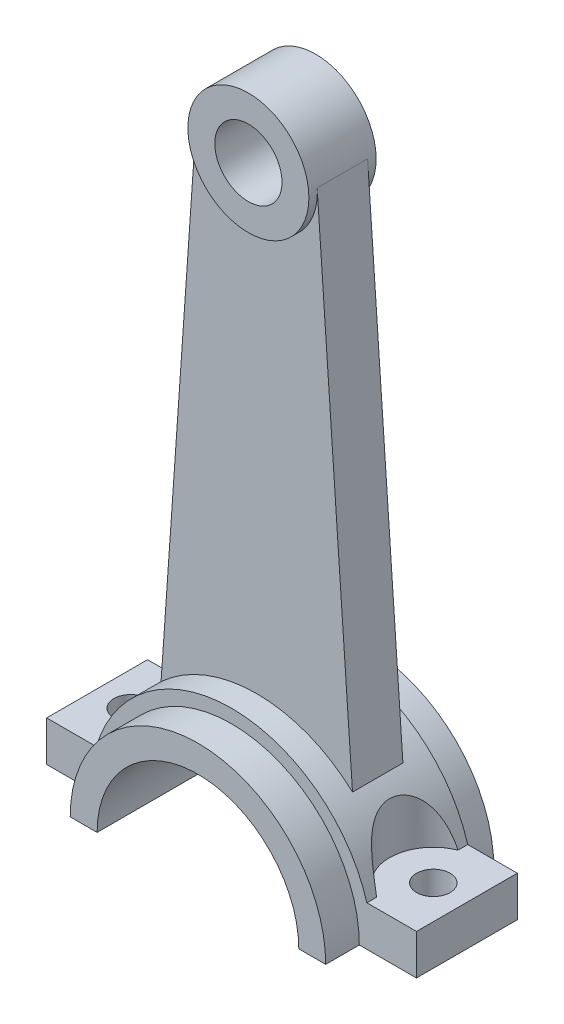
ISO-10303-21;
HEADER;
FILE_DESCRIPTION(('STEP AP214'),'2;1');
FILE_NAME('part.step','',(''),(''),'','','');
FILE_SCHEMA(('AUTOMOTIVE_DESIGN { 1 0 10303 214 1 1 1 1 }'));
ENDSEC;
DATA;
#1=APPLICATION_CONTEXT('core data for automotive mechanical design processes');
#2=APPLICATION_PROTOCOL_DEFINITION('international standard','automotive_design',2000,#1);
#3=PRODUCT_CONTEXT('',#1,'mechanical');
#4=PRODUCT('Part','Part','',(#3));
#5=PRODUCT_RELATED_PRODUCT_CATEGORY('part','',(#4));
#6=PRODUCT_DEFINITION_FORMATION('','',#4);
#7=PRODUCT_DEFINITION_CONTEXT('part definition',#1,'design');
#8=PRODUCT_DEFINITION('design','',#6,#7);
#9=PRODUCT_DEFINITION_SHAPE('','',#8);
#10=(LENGTH_UNIT() NAMED_UNIT(*) SI_UNIT(.MILLI.,.METRE.));
#11=(NAMED_UNIT(*) PLANE_ANGLE_UNIT() SI_UNIT($,.RADIAN.));
#12=(NAMED_UNIT(*) SI_UNIT($,.STERADIAN.) SOLID_ANGLE_UNIT());
#13=UNCERTAINTY_MEASURE_WITH_UNIT(LENGTH_MEASURE(1.E-05),#10,'distance_accuracy_value','');
#14=(GEOMETRIC_REPRESENTATION_CONTEXT(3) GLOBAL_UNCERTAINTY_ASSIGNED_CONTEXT((#13)) GLOBAL_UNIT_ASSIGNED_CONTEXT((#10,
#11,#12)) REPRESENTATION_CONTEXT('',''));
#15=CARTESIAN_POINT('',(0.,0.,0.));
#16=DIRECTION('',(0.,0.,1.));
#17=DIRECTION('',(1.,0.,0.));
#18=AXIS2_PLACEMENT_3D('',#15,#16,#17);
#19=CARTESIAN_POINT('',(0.,0.,15.));
#20=DIRECTION('',(0.,0.,-1.));
#21=DIRECTION('',(-1.,0.,0.));
#22=AXIS2_PLACEMENT_3D('',#19,#20,#21);
#23=CYLINDRICAL_SURFACE('',#22,42.);
#24=CARTESIAN_POINT('',(0.,0.,7.5));
#25=DIRECTION('',(0.,0.,1.));
#26=DIRECTION('',(1.,0.,0.));
#27=AXIS2_PLACEMENT_3D('',#24,#25,#26);
#28=CIRCLE('',#27,42.);
#29=CARTESIAN_POINT('',(28.4716791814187,30.8765847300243,7.5));
#30=VERTEX_POINT('',#29);
#31=CARTESIAN_POINT('',(-28.4716791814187,30.8765847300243,7.5));
#32=VERTEX_POINT('',#31);
#33=EDGE_CURVE('E218',#30,#32,#28,.T.);
#34=ORIENTED_EDGE('',*,*,#33,.T.);
#35=DIRECTION('',(0.,0.,-1.));
#36=VECTOR('',#35,1.);
#37=CARTESIAN_POINT('',(-28.4716791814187,30.8765847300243,7.5));
#38=LINE('',#37,#36);
#39=CARTESIAN_POINT('',(-28.4716791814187,30.8765847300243,-7.5));
#40=VERTEX_POINT('',#39);
#41=EDGE_CURVE('E233',#32,#40,#38,.T.);
#42=ORIENTED_EDGE('',*,*,#41,.T.);
#43=CARTESIAN_POINT('',(0.,0.,-7.5));
#44=DIRECTION('',(0.,0.,1.));
#45=DIRECTION('',(1.,0.,0.));
#46=AXIS2_PLACEMENT_3D('',#43,#44,#45);
#47=CIRCLE('',#46,42.);
#48=CARTESIAN_POINT('',(28.4716791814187,30.8765847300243,-7.5));
#49=VERTEX_POINT('',#48);
#50=EDGE_CURVE('E217',#49,#40,#47,.T.);
#51=ORIENTED_EDGE('',*,*,#50,.F.);
#52=DIRECTION('',(0.,0.,-1.));
#53=VECTOR('',#52,1.);
#54=CARTESIAN_POINT('',(28.4716791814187,30.8765847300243,7.5));
#55=LINE('',#54,#53);
#56=EDGE_CURVE('E257',#30,#49,#55,.T.);
#57=ORIENTED_EDGE('',*,*,#56,.F.);
#58=EDGE_LOOP('',(#34,#42,#51,#57));
#59=FACE_BOUND('',#58,.T.);
#60=DIRECTION('',(0.,0.,-1.));
#61=VECTOR('',#60,1.);
#62=CARTESIAN_POINT('',(40.2492235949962,12.,15.));
#63=LINE('',#62,#61);
#64=CARTESIAN_POINT('',(40.2492235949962,12.,15.));
#65=VERTEX_POINT('',#64);
#66=CARTESIAN_POINT('',(40.2492235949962,12.,12.1008315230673));
#67=VERTEX_POINT('',#66);
#68=EDGE_CURVE('E181',#65,#67,#63,.T.);
#69=ORIENTED_EDGE('',*,*,#68,.T.);
#70=CARTESIAN_POINT('',(40.2492235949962,12.,12.1008315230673));
#71=CARTESIAN_POINT('',(40.1309175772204,12.3968494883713,12.0543503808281));
#72=CARTESIAN_POINT('',(40.0068464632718,12.791522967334,12.0036697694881));
#73=CARTESIAN_POINT('',(39.747518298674,13.5759058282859,11.8925006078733));
#74=CARTESIAN_POINT('',(39.6122579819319,13.9656137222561,11.8320091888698));
#75=CARTESIAN_POINT('',(39.3301839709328,14.7413691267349,11.6994678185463));
#76=CARTESIAN_POINT('',(39.1833102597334,15.1273842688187,11.6273555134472));
#77=CARTESIAN_POINT('',(38.8792223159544,15.8926255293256,11.4701956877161));
#78=CARTESIAN_POINT('',(38.7220090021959,16.271852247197,11.3851493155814));
#79=CARTESIAN_POINT('',(38.3953697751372,17.0284470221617,11.1988733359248));
#80=CARTESIAN_POINT('',(38.2257905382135,17.4056917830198,11.0974099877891));
#81=CARTESIAN_POINT('',(37.8775953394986,18.1509483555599,10.8772143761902));
#82=CARTESIAN_POINT('',(37.6989783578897,18.5189591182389,10.7584801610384));
#83=CARTESIAN_POINT('',(37.3344196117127,19.2433129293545,10.5018308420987));
#84=CARTESIAN_POINT('',(37.1484969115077,19.599682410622,10.3639635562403));
#85=CARTESIAN_POINT('',(36.7705803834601,20.2998164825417,10.0665020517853));
#86=CARTESIAN_POINT('',(36.5785886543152,20.6435853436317,9.90691528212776));
#87=CARTESIAN_POINT('',(36.2204090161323,21.2647608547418,9.58993351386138));
#88=CARTESIAN_POINT('',(36.0547910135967,21.5442458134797,9.43597223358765));
#89=CARTESIAN_POINT('',(35.7222466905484,22.091254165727,9.10920625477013));
#90=CARTESIAN_POINT('',(35.5553202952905,22.3587768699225,8.93640047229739));
#91=CARTESIAN_POINT('',(35.222568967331,22.8793750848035,8.57103964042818));
#92=CARTESIAN_POINT('',(35.0567422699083,23.1324881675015,8.37853999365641));
#93=CARTESIAN_POINT('',(34.7280540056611,23.6230698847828,7.97216452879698));
#94=CARTESIAN_POINT('',(34.5651923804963,23.8605388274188,7.75828913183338));
#95=CARTESIAN_POINT('',(34.242873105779,24.3208905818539,7.30497501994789));
#96=CARTESIAN_POINT('',(34.0834981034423,24.5435144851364,7.06521288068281));
#97=CARTESIAN_POINT('',(33.7739183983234,24.9678077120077,6.56218584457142));
#98=CARTESIAN_POINT('',(33.6237146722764,25.1694748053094,6.29891845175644));
#99=CARTESIAN_POINT('',(33.3364418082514,25.5487412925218,5.7495507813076));
#100=CARTESIAN_POINT('',(33.1993524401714,25.7263779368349,5.46348696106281));
#101=CARTESIAN_POINT('',(32.9420563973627,26.0550283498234,4.86935523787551));
#102=CARTESIAN_POINT('',(32.8218410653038,26.206055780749,4.56129874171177));
#103=CARTESIAN_POINT('',(32.6365331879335,26.4361725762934,4.0247103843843));
#104=CARTESIAN_POINT('',(32.5659450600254,26.5230044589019,3.80135703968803));
#105=CARTESIAN_POINT('',(32.4358515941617,26.6819429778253,3.34635794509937));
#106=CARTESIAN_POINT('',(32.3763435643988,26.7540531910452,3.11471422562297));
#107=CARTESIAN_POINT('',(32.2695332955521,26.882786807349,2.64449056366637));
#108=CARTESIAN_POINT('',(32.222226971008,26.9394153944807,2.40591297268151));
#109=CARTESIAN_POINT('',(32.140727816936,27.0365982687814,1.92328011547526));
#110=CARTESIAN_POINT('',(32.1065355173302,27.077151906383,1.67922462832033));
#111=CARTESIAN_POINT('',(32.0518873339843,27.1418187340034,1.18658958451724));
#112=CARTESIAN_POINT('',(32.0314769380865,27.1658774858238,0.937997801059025));
#113=CARTESIAN_POINT('',(32.005012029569,27.1970518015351,0.438989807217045));
#114=CARTESIAN_POINT('',(31.9989574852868,27.2041674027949,0.188573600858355));
#115=CARTESIAN_POINT('',(32.0013358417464,27.2013695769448,-0.312076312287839));
#116=CARTESIAN_POINT('',(32.009767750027,27.1914573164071,-0.562310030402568));
#117=CARTESIAN_POINT('',(32.0409340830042,27.1547255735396,-1.06062701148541));
#118=CARTESIAN_POINT('',(32.0636680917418,27.1279065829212,-1.30871033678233));
#119=CARTESIAN_POINT('',(32.1214429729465,27.0594676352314,-1.78833114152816));
#120=CARTESIAN_POINT('',(32.1558004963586,27.0186681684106,-2.02006923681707));
#121=CARTESIAN_POINT('',(32.2363159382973,26.92255299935,-2.47840820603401));
#122=CARTESIAN_POINT('',(32.282473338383,26.8672379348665,-2.70500930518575));
#123=CARTESIAN_POINT('',(32.3857571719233,26.7426488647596,-3.15173505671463));
#124=CARTESIAN_POINT('',(32.4428822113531,26.6733766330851,-3.37186052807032));
#125=CARTESIAN_POINT('',(32.5671588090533,26.5214968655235,-3.80462539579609));
#126=CARTESIAN_POINT('',(32.6343140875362,26.4388843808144,-4.0172619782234));
#127=CARTESIAN_POINT('',(32.7818239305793,26.2557920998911,-4.4464191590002));
#128=CARTESIAN_POINT('',(32.8627245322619,26.1545440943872,-4.66242449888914));
#129=CARTESIAN_POINT('',(33.0332569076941,25.9388300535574,-5.08417948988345));
#130=CARTESIAN_POINT('',(33.1228920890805,25.824358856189,-5.28992509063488));
#131=CARTESIAN_POINT('',(33.4029039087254,25.462493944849,-5.89087373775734));
#132=CARTESIAN_POINT('',(33.6044530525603,25.1965679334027,-6.26997592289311));
#133=CARTESIAN_POINT('',(33.9762542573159,24.6918579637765,-6.89759313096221));
#134=CARTESIAN_POINT('',(34.1425010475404,24.4617348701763,-7.15568508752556));
#135=CARTESIAN_POINT('',(34.4822895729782,23.9803760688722,-7.64635612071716));
#136=CARTESIAN_POINT('',(34.65583437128,23.7291314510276,-7.87892433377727));
#137=CARTESIAN_POINT('',(35.0069944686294,23.2079570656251,-8.31982468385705));
#138=CARTESIAN_POINT('',(35.184616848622,22.9379928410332,-8.52811012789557));
#139=CARTESIAN_POINT('',(35.540711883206,22.3822882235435,-8.92144710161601));
#140=CARTESIAN_POINT('',(35.719184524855,22.0965480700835,-9.10649898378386));
#141=CARTESIAN_POINT('',(36.1676144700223,21.3582539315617,-9.546356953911));
#142=CARTESIAN_POINT('',(36.4365844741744,20.8966371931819,-9.78700619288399));
#143=CARTESIAN_POINT('',(36.9645825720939,19.9478076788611,-10.2249588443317));
#144=CARTESIAN_POINT('',(37.2236045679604,19.4605796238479,-10.4222360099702));
#145=CARTESIAN_POINT('',(37.7276625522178,18.4644458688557,-10.780019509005));
#146=CARTESIAN_POINT('',(37.9726662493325,17.955494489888,-10.9404433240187));
#147=CARTESIAN_POINT('',(38.4448252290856,16.9209588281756,-11.2297046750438));
#148=CARTESIAN_POINT('',(38.6719856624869,16.3953794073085,-11.3585513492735));
#149=CARTESIAN_POINT('',(39.1459118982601,15.2334949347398,-11.6109593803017));
#150=CARTESIAN_POINT('',(39.3887267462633,14.5944403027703,-11.729295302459));
#151=CARTESIAN_POINT('',(39.7294482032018,13.626704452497,-11.884301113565));
#152=CARTESIAN_POINT('',(39.8387770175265,13.303700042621,-11.9320968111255));
#153=CARTESIAN_POINT('',(40.0497825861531,12.6543053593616,-12.0211654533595));
#154=CARTESIAN_POINT('',(40.1514592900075,12.3279150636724,-12.0624383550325));
#155=CARTESIAN_POINT('',(40.2492235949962,12.,-12.1008315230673));
#156=B_SPLINE_CURVE_WITH_KNOTS('',3,(#70,#71,#72,#73,#74,#75,#76,#77,#78,#79,#80,#81,#82,#83,
#84,#85,#86,#87,#88,#89,#90,#91,#92,#93,#94,#95,#96,#97,#98,#99,#100,#101,#102,#103,#104,#105,
#106,#107,#108,#109,#110,#111,#112,#113,#114,#115,#116,#117,#118,#119,#120,#121,#122,#123,#124,
#125,#126,#127,#128,#129,#130,#131,#132,#133,#134,#135,#136,#137,#138,#139,#140,#141,#142,#143,
#144,#145,#146,#147,#148,#149,#150,#151,#152,#153,#154,#155),.UNSPECIFIED.,.F.,.F.,(4,2,2,2,2,2,
2,2,2,2,2,2,2,2,2,2,2,2,2,2,2,2,2,2,2,2,2,2,2,2,2,2,2,2,2,2,2,2,2,2,2,2,4),(0.,1.25010931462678,
2.50058482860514,3.75800820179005,5.0153199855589,6.29242991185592,7.56968426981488,
8.84380211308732,10.1174840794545,11.1953857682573,12.2733494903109,13.3483599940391,
14.4233493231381,15.5137997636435,16.6043661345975,17.6932221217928,18.7815174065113,
19.5302379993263,20.2787764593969,21.0270639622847,21.7753816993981,22.5261573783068,
23.276931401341,24.0276539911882,24.7783547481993,25.4909459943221,26.2035059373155,
26.9159753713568,27.6287097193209,28.3836371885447,29.1388603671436,30.6486691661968,
31.7982708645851,32.9483599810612,34.1006253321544,35.2528731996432,37.0079443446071,
38.7640746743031,40.5240996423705,42.2836146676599,44.3632126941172,45.3960974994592,
46.4289891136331),.UNSPECIFIED.);
#157=CARTESIAN_POINT('',(40.2492235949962,12.,-12.1008315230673));
#158=VERTEX_POINT('',#157);
#159=EDGE_CURVE('E171',#67,#158,#156,.T.);
#160=ORIENTED_EDGE('',*,*,#159,.T.);
#161=CARTESIAN_POINT('',(40.2492235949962,12.,-15.));
#162=VERTEX_POINT('',#161);
#163=EDGE_CURVE('E178',#158,#162,#63,.T.);
#164=ORIENTED_EDGE('',*,*,#163,.T.);
#165=CARTESIAN_POINT('',(0.,0.,-15.));
#166=DIRECTION('',(0.,0.,1.));
#167=DIRECTION('',(1.,0.,0.));
#168=AXIS2_PLACEMENT_3D('',#165,#166,#167);
#169=CIRCLE('',#168,42.);
#170=CARTESIAN_POINT('',(-40.2492235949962,12.,-15.));
#171=VERTEX_POINT('',#170);
#172=EDGE_CURVE('E449',#162,#171,#169,.T.);
#173=ORIENTED_EDGE('',*,*,#172,.T.);
#174=DIRECTION('',(0.,0.,-1.));
#175=VECTOR('',#174,1.);
#176=CARTESIAN_POINT('',(-40.2492235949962,12.,15.));
#177=LINE('',#176,#175);
#178=CARTESIAN_POINT('',(-40.2492235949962,12.,-12.1008315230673));
#179=VERTEX_POINT('',#178);
#180=EDGE_CURVE('E213',#179,#171,#177,.T.);
#181=ORIENTED_EDGE('',*,*,#180,.F.);
#182=CARTESIAN_POINT('',(-40.2492235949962,12.,12.1008315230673));
#183=CARTESIAN_POINT('',(-40.1309175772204,12.3968494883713,12.0543503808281));
#184=CARTESIAN_POINT('',(-40.0068464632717,12.7915229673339,12.0036697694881));
#185=CARTESIAN_POINT('',(-39.747518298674,13.5759058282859,11.8925006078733));
#186=CARTESIAN_POINT('',(-39.6122579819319,13.9656137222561,11.8320091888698));
#187=CARTESIAN_POINT('',(-39.3301839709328,14.7413691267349,11.6994678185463));
#188=CARTESIAN_POINT('',(-39.1833102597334,15.1273842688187,11.6273555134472));
#189=CARTESIAN_POINT('',(-38.8792223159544,15.8926255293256,11.4701956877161));
#190=CARTESIAN_POINT('',(-38.7220090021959,16.271852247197,11.3851493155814));
#191=CARTESIAN_POINT('',(-38.3953697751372,17.0284470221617,11.1988733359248));
#192=CARTESIAN_POINT('',(-38.2257905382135,17.4056917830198,11.0974099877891));
#193=CARTESIAN_POINT('',(-37.8775953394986,18.1509483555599,10.8772143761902));
#194=CARTESIAN_POINT('',(-37.6989783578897,18.5189591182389,10.7584801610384));
#195=CARTESIAN_POINT('',(-37.3344196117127,19.2433129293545,10.5018308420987));
#196=CARTESIAN_POINT('',(-37.1484969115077,19.599682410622,10.3639635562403));
#197=CARTESIAN_POINT('',(-36.7705803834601,20.2998164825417,10.0665020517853));
#198=CARTESIAN_POINT('',(-36.5785886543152,20.6435853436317,9.90691528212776));
#199=CARTESIAN_POINT('',(-36.2204090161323,21.2647608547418,9.58993351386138));
#200=CARTESIAN_POINT('',(-36.0547910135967,21.5442458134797,9.43597223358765));
#201=CARTESIAN_POINT('',(-35.7222466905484,22.091254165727,9.10920625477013));
#202=CARTESIAN_POINT('',(-35.5553202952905,22.3587768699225,8.93640047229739));
#203=CARTESIAN_POINT('',(-35.222568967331,22.8793750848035,8.57103964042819));
#204=CARTESIAN_POINT('',(-35.0567422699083,23.1324881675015,8.37853999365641));
#205=CARTESIAN_POINT('',(-34.7280540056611,23.6230698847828,7.97216452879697));
#206=CARTESIAN_POINT('',(-34.5651923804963,23.8605388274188,7.75828913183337));
#207=CARTESIAN_POINT('',(-34.242873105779,24.3208905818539,7.30497501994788));
#208=CARTESIAN_POINT('',(-34.0834981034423,24.5435144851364,7.06521288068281));
#209=CARTESIAN_POINT('',(-33.7739183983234,24.9678077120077,6.56218584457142));
#210=CARTESIAN_POINT('',(-33.6237146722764,25.1694748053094,6.29891845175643));
#211=CARTESIAN_POINT('',(-33.3364418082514,25.5487412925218,5.7495507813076));
#212=CARTESIAN_POINT('',(-33.1993524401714,25.7263779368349,5.46348696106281));
#213=CARTESIAN_POINT('',(-32.9420563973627,26.0550283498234,4.86935523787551));
#214=CARTESIAN_POINT('',(-32.8218410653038,26.206055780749,4.56129874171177));
#215=CARTESIAN_POINT('',(-32.6365331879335,26.4361725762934,4.02471038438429));
#216=CARTESIAN_POINT('',(-32.5659450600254,26.5230044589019,3.80135703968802));
#217=CARTESIAN_POINT('',(-32.4358515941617,26.6819429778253,3.34635794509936));
#218=CARTESIAN_POINT('',(-32.3763435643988,26.7540531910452,3.11471422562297));
#219=CARTESIAN_POINT('',(-32.2695332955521,26.882786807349,2.64449056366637));
#220=CARTESIAN_POINT('',(-32.222226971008,26.9394153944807,2.4059129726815));
#221=CARTESIAN_POINT('',(-32.140727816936,27.0365982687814,1.92328011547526));
#222=CARTESIAN_POINT('',(-32.1065355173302,27.077151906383,1.67922462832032));
#223=CARTESIAN_POINT('',(-32.0518873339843,27.1418187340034,1.18658958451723));
#224=CARTESIAN_POINT('',(-32.0314769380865,27.1658774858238,0.937997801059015));
#225=CARTESIAN_POINT('',(-32.005012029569,27.197051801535,0.438989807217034));
#226=CARTESIAN_POINT('',(-31.9989574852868,27.2041674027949,0.188573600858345));
#227=CARTESIAN_POINT('',(-32.0013358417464,27.2013695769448,-0.312076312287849));
#228=CARTESIAN_POINT('',(-32.009767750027,27.1914573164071,-0.562310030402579));
#229=CARTESIAN_POINT('',(-32.0409340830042,27.1547255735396,-1.06062701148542));
#230=CARTESIAN_POINT('',(-32.0636680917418,27.1279065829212,-1.30871033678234));
#231=CARTESIAN_POINT('',(-32.1214429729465,27.0594676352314,-1.78833114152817));
#232=CARTESIAN_POINT('',(-32.1558004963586,27.0186681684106,-2.02006923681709));
#233=CARTESIAN_POINT('',(-32.2363159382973,26.92255299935,-2.47840820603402));
#234=CARTESIAN_POINT('',(-32.282473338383,26.8672379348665,-2.70500930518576));
#235=CARTESIAN_POINT('',(-32.3857571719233,26.7426488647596,-3.15173505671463));
#236=CARTESIAN_POINT('',(-32.4428822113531,26.6733766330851,-3.37186052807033));
#237=CARTESIAN_POINT('',(-32.5671588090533,26.5214968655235,-3.8046253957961));
#238=CARTESIAN_POINT('',(-32.6343140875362,26.4388843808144,-4.01726197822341));
#239=CARTESIAN_POINT('',(-32.7818239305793,26.2557920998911,-4.44641915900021));
#240=CARTESIAN_POINT('',(-32.8627245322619,26.1545440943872,-4.66242449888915));
#241=CARTESIAN_POINT('',(-33.0332569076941,25.9388300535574,-5.08417948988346));
#242=CARTESIAN_POINT('',(-33.1228920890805,25.824358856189,-5.28992509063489));
#243=CARTESIAN_POINT('',(-33.4029039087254,25.462493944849,-5.89087373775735));
#244=CARTESIAN_POINT('',(-33.6044530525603,25.1965679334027,-6.26997592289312));
#245=CARTESIAN_POINT('',(-33.9762542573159,24.6918579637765,-6.89759313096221));
#246=CARTESIAN_POINT('',(-34.1425010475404,24.4617348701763,-7.15568508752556));
#247=CARTESIAN_POINT('',(-34.4822895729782,23.9803760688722,-7.64635612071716));
#248=CARTESIAN_POINT('',(-34.65583437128,23.7291314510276,-7.87892433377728));
#249=CARTESIAN_POINT('',(-35.0069944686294,23.2079570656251,-8.31982468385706));
#250=CARTESIAN_POINT('',(-35.184616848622,22.9379928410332,-8.52811012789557));
#251=CARTESIAN_POINT('',(-35.540711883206,22.3822882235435,-8.92144710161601));
#252=CARTESIAN_POINT('',(-35.719184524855,22.0965480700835,-9.10649898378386));
#253=CARTESIAN_POINT('',(-36.1676144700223,21.3582539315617,-9.546356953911));
#254=CARTESIAN_POINT('',(-36.4365844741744,20.8966371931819,-9.78700619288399));
#255=CARTESIAN_POINT('',(-36.9645825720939,19.9478076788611,-10.2249588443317));
#256=CARTESIAN_POINT('',(-37.2236045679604,19.4605796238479,-10.4222360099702));
#257=CARTESIAN_POINT('',(-37.7276625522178,18.4644458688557,-10.780019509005));
#258=CARTESIAN_POINT('',(-37.9726662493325,17.955494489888,-10.9404433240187));
#259=CARTESIAN_POINT('',(-38.4448252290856,16.9209588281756,-11.2297046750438));
#260=CARTESIAN_POINT('',(-38.6719856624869,16.3953794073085,-11.3585513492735));
#261=CARTESIAN_POINT('',(-39.1459118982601,15.2334949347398,-11.6109593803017));
#262=CARTESIAN_POINT('',(-39.3887267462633,14.5944403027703,-11.729295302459));
#263=CARTESIAN_POINT('',(-39.7294482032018,13.626704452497,-11.884301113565));
#264=CARTESIAN_POINT('',(-39.8387770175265,13.303700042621,-11.9320968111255));
#265=CARTESIAN_POINT('',(-40.0497825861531,12.6543053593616,-12.0211654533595));
#266=CARTESIAN_POINT('',(-40.1514592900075,12.3279150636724,-12.0624383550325));
#267=CARTESIAN_POINT('',(-40.2492235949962,12.,-12.1008315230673));
#268=B_SPLINE_CURVE_WITH_KNOTS('',3,(#182,#183,#184,#185,#186,#187,#188,#189,#190,#191,#192,
#193,#194,#195,#196,#197,#198,#199,#200,#201,#202,#203,#204,#205,#206,#207,#208,#209,#210,#211,
#212,#213,#214,#215,#216,#217,#218,#219,#220,#221,#222,#223,#224,#225,#226,#227,#228,#229,#230,
#231,#232,#233,#234,#235,#236,#237,#238,#239,#240,#241,#242,#243,#244,#245,#246,#247,#248,#249,
#250,#251,#252,#253,#254,#255,#256,#257,#258,#259,#260,#261,#262,#263,#264,#265,#266,#267),
.UNSPECIFIED.,.F.,.F.,(4,2,2,2,2,2,2,2,2,2,2,2,2,2,2,2,2,2,2,2,2,2,2,2,2,2,2,2,2,2,2,2,2,2,2,2,
2,2,2,2,2,2,4),(0.,1.25010931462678,2.50058482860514,3.75800820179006,5.01531998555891,
6.29242991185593,7.56968426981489,8.84380211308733,10.1174840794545,11.1953857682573,
12.2733494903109,13.3483599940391,14.4233493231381,15.5137997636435,16.6043661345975,
17.6932221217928,18.7815174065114,19.5302379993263,20.2787764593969,21.0270639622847,
21.7753816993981,22.5261573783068,23.276931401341,24.0276539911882,24.7783547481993,
25.4909459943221,26.2035059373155,26.9159753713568,27.6287097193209,28.3836371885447,
29.1388603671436,30.6486691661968,31.7982708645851,32.9483599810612,34.1006253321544,
35.2528731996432,37.0079443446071,38.7640746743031,40.5240996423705,42.2836146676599,
44.3632126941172,45.3960974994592,46.4289891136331),.UNSPECIFIED.);
#269=CARTESIAN_POINT('',(-40.2492235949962,12.,12.1008315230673));
#270=VERTEX_POINT('',#269);
#271=EDGE_CURVE('E309',#270,#179,#268,.T.);
#272=ORIENTED_EDGE('',*,*,#271,.F.);
#273=CARTESIAN_POINT('',(-40.2492235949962,12.,15.));
#274=VERTEX_POINT('',#273);
#275=EDGE_CURVE('E214',#274,#270,#177,.T.);
#276=ORIENTED_EDGE('',*,*,#275,.F.);
#277=CARTESIAN_POINT('',(0.,0.,15.));
#278=DIRECTION('',(0.,0.,1.));
#279=DIRECTION('',(1.,0.,0.));
#280=AXIS2_PLACEMENT_3D('',#277,#278,#279);
#281=CIRCLE('',#280,42.);
#282=EDGE_CURVE('E416',#65,#274,#281,.T.);
#283=ORIENTED_EDGE('',*,*,#282,.F.);
#284=EDGE_LOOP('',(#69,#160,#164,#173,#181,#272,#276,#283));
#285=FACE_BOUND('',#284,.T.);
#286=ADVANCED_FACE('F43',(#59,#285),#23,.T.);
#287=CARTESIAN_POINT('',(0.,180.,10.));
#288=DIRECTION('',(0.,0.,-1.));
#289=DIRECTION('',(-1.,0.,0.));
#290=AXIS2_PLACEMENT_3D('',#287,#288,#289);
#291=CYLINDRICAL_SURFACE('',#290,10.);
#292=CARTESIAN_POINT('',(0.,180.,10.));
#293=DIRECTION('',(0.,0.,1.));
#294=DIRECTION('',(1.,0.,0.));
#295=AXIS2_PLACEMENT_3D('',#292,#293,#294);
#296=CIRCLE('',#295,10.);
#297=CARTESIAN_POINT('',(10.,180.,10.));
#298=VERTEX_POINT('',#297);
#299=EDGE_CURVE('E53',#298,#298,#296,.T.);
#300=ORIENTED_EDGE('',*,*,#299,.T.);
#301=EDGE_LOOP('',(#300));
#302=FACE_BOUND('',#301,.T.);
#303=CARTESIAN_POINT('',(0.,180.,-10.));
#304=DIRECTION('',(0.,0.,1.));
#305=DIRECTION('',(1.,0.,0.));
#306=AXIS2_PLACEMENT_3D('',#303,#304,#305);
#307=CIRCLE('',#306,10.);
#308=CARTESIAN_POINT('',(10.,180.,-10.));
#309=VERTEX_POINT('',#308);
#310=EDGE_CURVE('E261',#309,#309,#307,.T.);
#311=ORIENTED_EDGE('',*,*,#310,.F.);
#312=EDGE_LOOP('',(#311));
#313=FACE_BOUND('',#312,.T.);
#314=ADVANCED_FACE('F45',(#302,#313),#291,.F.);
#315=CARTESIAN_POINT('',(0.,180.,10.));
#316=DIRECTION('',(0.,0.,-1.));
#317=DIRECTION('',(-1.,0.,0.));
#318=AXIS2_PLACEMENT_3D('',#315,#316,#317);
#319=CYLINDRICAL_SURFACE('',#318,18.);
#320=DIRECTION('',(0.,0.,-1.));
#321=VECTOR('',#320,1.);
#322=CARTESIAN_POINT('',(-17.9561529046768,181.255616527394,7.5));
#323=LINE('',#322,#321);
#324=CARTESIAN_POINT('',(-17.9561529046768,181.255616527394,7.5));
#325=VERTEX_POINT('',#324);
#326=CARTESIAN_POINT('',(-17.9561529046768,181.255616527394,-7.5));
#327=VERTEX_POINT('',#326);
#328=EDGE_CURVE('E250',#325,#327,#323,.T.);
#329=ORIENTED_EDGE('',*,*,#328,.F.);
#330=CARTESIAN_POINT('',(0.,180.,7.5));
#331=DIRECTION('',(0.,0.,1.));
#332=DIRECTION('',(1.,0.,0.));
#333=AXIS2_PLACEMENT_3D('',#330,#331,#332);
#334=CIRCLE('',#333,18.);
#335=CARTESIAN_POINT('',(17.9561529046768,181.255616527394,7.5));
#336=VERTEX_POINT('',#335);
#337=EDGE_CURVE('E226',#325,#336,#334,.T.);
#338=ORIENTED_EDGE('',*,*,#337,.T.);
#339=DIRECTION('',(0.,0.,-1.));
#340=VECTOR('',#339,1.);
#341=CARTESIAN_POINT('',(17.9561529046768,181.255616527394,7.5));
#342=LINE('',#341,#340);
#343=CARTESIAN_POINT('',(17.9561529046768,181.255616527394,-7.5));
#344=VERTEX_POINT('',#343);
#345=EDGE_CURVE('E254',#336,#344,#342,.T.);
#346=ORIENTED_EDGE('',*,*,#345,.T.);
#347=CARTESIAN_POINT('',(0.,180.,-7.5));
#348=DIRECTION('',(0.,0.,1.));
#349=DIRECTION('',(1.,0.,0.));
#350=AXIS2_PLACEMENT_3D('',#347,#348,#349);
#351=CIRCLE('',#350,18.);
#352=EDGE_CURVE('E241',#327,#344,#351,.T.);
#353=ORIENTED_EDGE('',*,*,#352,.F.);
#354=EDGE_LOOP('',(#329,#338,#346,#353));
#355=FACE_BOUND('',#354,.T.);
#356=CARTESIAN_POINT('',(0.,180.,10.));
#357=DIRECTION('',(0.,0.,1.));
#358=DIRECTION('',(1.,0.,0.));
#359=AXIS2_PLACEMENT_3D('',#356,#357,#358);
#360=CIRCLE('',#359,18.);
#361=CARTESIAN_POINT('',(18.,180.,10.));
#362=VERTEX_POINT('',#361);
#363=EDGE_CURVE('E11',#362,#362,#360,.T.);
#364=ORIENTED_EDGE('',*,*,#363,.F.);
#365=EDGE_LOOP('',(#364));
#366=FACE_BOUND('',#365,.T.);
#367=CARTESIAN_POINT('',(0.,180.,-10.));
#368=DIRECTION('',(0.,0.,1.));
#369=DIRECTION('',(1.,0.,0.));
#370=AXIS2_PLACEMENT_3D('',#367,#368,#369);
#371=CIRCLE('',#370,18.);
#372=CARTESIAN_POINT('',(18.,180.,-10.));
#373=VERTEX_POINT('',#372);
#374=EDGE_CURVE('E47',#373,#373,#371,.T.);
#375=ORIENTED_EDGE('',*,*,#374,.T.);
#376=EDGE_LOOP('',(#375));
#377=FACE_BOUND('',#376,.T.);
#378=ADVANCED_FACE('F274',(#355,#366,#377),#319,.T.);
#379=CARTESIAN_POINT('',(0.,0.,10.));
#380=DIRECTION('',(0.,0.,1.));
#381=DIRECTION('',(1.,0.,0.));
#382=AXIS2_PLACEMENT_3D('',#379,#380,#381);
#383=PLANE('',#382);
#384=ORIENTED_EDGE('',*,*,#299,.F.);
#385=EDGE_LOOP('',(#384));
#386=FACE_BOUND('',#385,.T.);
#387=ORIENTED_EDGE('',*,*,#363,.T.);
#388=EDGE_LOOP('',(#387));
#389=FACE_BOUND('',#388,.T.);
#390=ADVANCED_FACE('F279',(#386,#389),#383,.T.);
#391=CARTESIAN_POINT('',(0.,0.,-10.));
#392=DIRECTION('',(0.,0.,1.));
#393=DIRECTION('',(1.,0.,0.));
#394=AXIS2_PLACEMENT_3D('',#391,#392,#393);
#395=PLANE('',#394);
#396=ORIENTED_EDGE('',*,*,#310,.T.);
#397=EDGE_LOOP('',(#396));
#398=FACE_BOUND('',#397,.T.);
#399=ORIENTED_EDGE('',*,*,#374,.F.);
#400=EDGE_LOOP('',(#399));
#401=FACE_BOUND('',#400,.T.);
#402=ADVANCED_FACE('F276',(#398,#401),#395,.F.);
#403=CARTESIAN_POINT('',(30.4817319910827,2.13149034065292,7.5));
#404=DIRECTION('',(0.997564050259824,0.0697564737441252,0.));
#405=DIRECTION('',(-0.0697564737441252,0.997564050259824,0.));
#406=AXIS2_PLACEMENT_3D('',#403,#404,#405);
#407=PLANE('',#406);
#408=DIRECTION('',(0.0697564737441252,-0.997564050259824,0.));
#409=VECTOR('',#408,1.);
#410=CARTESIAN_POINT('',(30.4817319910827,2.13149034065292,-7.5));
#411=LINE('',#410,#409);
#412=EDGE_CURVE('E237',#344,#49,#411,.T.);
#413=ORIENTED_EDGE('',*,*,#412,.F.);
#414=ORIENTED_EDGE('',*,*,#345,.F.);
#415=DIRECTION('',(0.0697564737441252,-0.997564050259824,0.));
#416=VECTOR('',#415,1.);
#417=CARTESIAN_POINT('',(30.4817319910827,2.13149034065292,7.5));
#418=LINE('',#417,#416);
#419=EDGE_CURVE('E221',#336,#30,#418,.T.);
#420=ORIENTED_EDGE('',*,*,#419,.T.);
#421=ORIENTED_EDGE('',*,*,#56,.T.);
#422=EDGE_LOOP('',(#413,#414,#420,#421));
#423=FACE_BOUND('',#422,.T.);
#424=ADVANCED_FACE('F278',(#423),#407,.T.);
#425=CARTESIAN_POINT('',(-30.4817319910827,2.13149034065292,7.5));
#426=DIRECTION('',(0.997564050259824,-0.0697564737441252,0.));
#427=DIRECTION('',(0.0697564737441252,0.997564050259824,0.));
#428=AXIS2_PLACEMENT_3D('',#425,#426,#427);
#429=PLANE('',#428);
#430=DIRECTION('',(-0.0697564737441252,-0.997564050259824,0.));
#431=VECTOR('',#430,1.);
#432=CARTESIAN_POINT('',(-30.4817319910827,2.13149034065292,-7.5));
#433=LINE('',#432,#431);
#434=EDGE_CURVE('E222',#327,#40,#433,.T.);
#435=ORIENTED_EDGE('',*,*,#434,.T.);
#436=ORIENTED_EDGE('',*,*,#41,.F.);
#437=DIRECTION('',(-0.0697564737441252,-0.997564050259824,0.));
#438=VECTOR('',#437,1.);
#439=CARTESIAN_POINT('',(-30.4817319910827,2.13149034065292,7.5));
#440=LINE('',#439,#438);
#441=EDGE_CURVE('E229',#325,#32,#440,.T.);
#442=ORIENTED_EDGE('',*,*,#441,.F.);
#443=ORIENTED_EDGE('',*,*,#328,.T.);
#444=EDGE_LOOP('',(#435,#436,#442,#443));
#445=FACE_BOUND('',#444,.T.);
#446=ADVANCED_FACE('F286',(#445),#429,.F.);
#447=CARTESIAN_POINT('',(0.,0.,7.5));
#448=DIRECTION('',(0.,0.,1.));
#449=DIRECTION('',(1.,0.,0.));
#450=AXIS2_PLACEMENT_3D('',#447,#448,#449);
#451=PLANE('',#450);
#452=ORIENTED_EDGE('',*,*,#33,.F.);
#453=ORIENTED_EDGE('',*,*,#419,.F.);
#454=ORIENTED_EDGE('',*,*,#337,.F.);
#455=ORIENTED_EDGE('',*,*,#441,.T.);
#456=EDGE_LOOP('',(#452,#453,#454,#455));
#457=FACE_BOUND('',#456,.T.);
#458=ADVANCED_FACE('F305',(#457),#451,.T.);
#459=CARTESIAN_POINT('',(0.,0.,-7.5));
#460=DIRECTION('',(0.,0.,1.));
#461=DIRECTION('',(1.,0.,0.));
#462=AXIS2_PLACEMENT_3D('',#459,#460,#461);
#463=PLANE('',#462);
#464=ORIENTED_EDGE('',*,*,#50,.T.);
#465=ORIENTED_EDGE('',*,*,#434,.F.);
#466=ORIENTED_EDGE('',*,*,#352,.T.);
#467=ORIENTED_EDGE('',*,*,#412,.T.);
#468=EDGE_LOOP('',(#464,#465,#466,#467));
#469=FACE_BOUND('',#468,.T.);
#470=ADVANCED_FACE('F382',(#469),#463,.F.);
#471=CARTESIAN_POINT('',(0.,12.,15.));
#472=DIRECTION('',(0.,1.,0.));
#473=DIRECTION('',(0.,0.,1.));
#474=AXIS2_PLACEMENT_3D('',#471,#472,#473);
#475=PLANE('',#474);
#476=CARTESIAN_POINT('',(-45.,12.,0.));
#477=DIRECTION('',(0.,1.,0.));
#478=DIRECTION('',(0.,0.,1.));
#479=AXIS2_PLACEMENT_3D('',#476,#477,#478);
#480=CIRCLE('',#479,5.);
#481=CARTESIAN_POINT('',(-45.,12.,5.));
#482=VERTEX_POINT('',#481);
#483=EDGE_CURVE('E183',#482,#482,#480,.T.);
#484=ORIENTED_EDGE('',*,*,#483,.F.);
#485=EDGE_LOOP('',(#484));
#486=FACE_BOUND('',#485,.T.);
#487=ORIENTED_EDGE('',*,*,#275,.T.);
#488=CARTESIAN_POINT('',(-45.,12.,0.));
#489=DIRECTION('',(0.,1.,0.));
#490=DIRECTION('',(0.,0.,1.));
#491=AXIS2_PLACEMENT_3D('',#488,#489,#490);
#492=CIRCLE('',#491,13.);
#493=EDGE_CURVE('E69',#270,#179,#492,.T.);
#494=ORIENTED_EDGE('',*,*,#493,.T.);
#495=ORIENTED_EDGE('',*,*,#180,.T.);
#496=DIRECTION('',(1.,0.,0.));
#497=VECTOR('',#496,1.);
#498=CARTESIAN_POINT('',(0.,12.,-15.));
#499=LINE('',#498,#497);
#500=CARTESIAN_POINT('',(-55.,12.,-15.));
#501=VERTEX_POINT('',#500);
#502=EDGE_CURVE('E394',#501,#171,#499,.T.);
#503=ORIENTED_EDGE('',*,*,#502,.F.);
#504=DIRECTION('',(0.,0.,-1.));
#505=VECTOR('',#504,1.);
#506=CARTESIAN_POINT('',(-55.,12.,15.));
#507=LINE('',#506,#505);
#508=CARTESIAN_POINT('',(-55.,12.,15.));
#509=VERTEX_POINT('',#508);
#510=EDGE_CURVE('E210',#509,#501,#507,.T.);
#511=ORIENTED_EDGE('',*,*,#510,.F.);
#512=DIRECTION('',(1.,0.,0.));
#513=VECTOR('',#512,1.);
#514=CARTESIAN_POINT('',(0.,12.,15.));
#515=LINE('',#514,#513);
#516=EDGE_CURVE('E419',#509,#274,#515,.T.);
#517=ORIENTED_EDGE('',*,*,#516,.T.);
#518=EDGE_LOOP('',(#487,#494,#495,#503,#511,#517));
#519=FACE_BOUND('',#518,.T.);
#520=ADVANCED_FACE('F303',(#486,#519),#475,.T.);
#521=CARTESIAN_POINT('',(-55.,0.,15.));
#522=DIRECTION('',(-1.,0.,0.));
#523=DIRECTION('',(0.,0.,1.));
#524=AXIS2_PLACEMENT_3D('',#521,#522,#523);
#525=PLANE('',#524);
#526=DIRECTION('',(0.,1.,0.));
#527=VECTOR('',#526,1.);
#528=CARTESIAN_POINT('',(-55.,0.,-15.));
#529=LINE('',#528,#527);
#530=CARTESIAN_POINT('',(-55.,0.,-15.));
#531=VERTEX_POINT('',#530);
#532=EDGE_CURVE('E386',#531,#501,#529,.T.);
#533=ORIENTED_EDGE('',*,*,#532,.F.);
#534=DIRECTION('',(0.,0.,-1.));
#535=VECTOR('',#534,1.);
#536=CARTESIAN_POINT('',(-55.,0.,15.));
#537=LINE('',#536,#535);
#538=CARTESIAN_POINT('',(-55.,0.,15.));
#539=VERTEX_POINT('',#538);
#540=EDGE_CURVE('E207',#539,#531,#537,.T.);
#541=ORIENTED_EDGE('',*,*,#540,.F.);
#542=DIRECTION('',(0.,1.,0.));
#543=VECTOR('',#542,1.);
#544=CARTESIAN_POINT('',(-55.,0.,15.));
#545=LINE('',#544,#543);
#546=EDGE_CURVE('E427',#539,#509,#545,.T.);
#547=ORIENTED_EDGE('',*,*,#546,.T.);
#548=ORIENTED_EDGE('',*,*,#510,.T.);
#549=EDGE_LOOP('',(#533,#541,#547,#548));
#550=FACE_BOUND('',#549,.T.);
#551=ADVANCED_FACE('F375',(#550),#525,.T.);
#552=CARTESIAN_POINT('',(0.,0.,15.));
#553=DIRECTION('',(0.,-1.,0.));
#554=DIRECTION('',(1.,0.,0.));
#555=AXIS2_PLACEMENT_3D('',#552,#553,#554);
#556=PLANE('',#555);
#557=CARTESIAN_POINT('',(-45.,0.,0.));
#558=DIRECTION('',(0.,1.,0.));
#559=DIRECTION('',(0.,0.,1.));
#560=AXIS2_PLACEMENT_3D('',#557,#558,#559);
#561=CIRCLE('',#560,5.);
#562=CARTESIAN_POINT('',(-45.,0.,5.));
#563=VERTEX_POINT('',#562);
#564=EDGE_CURVE('E324',#563,#563,#561,.T.);
#565=ORIENTED_EDGE('',*,*,#564,.T.);
#566=EDGE_LOOP('',(#565));
#567=FACE_BOUND('',#566,.T.);
#568=DIRECTION('',(-1.,0.,0.));
#569=VECTOR('',#568,1.);
#570=CARTESIAN_POINT('',(0.,0.,-15.));
#571=LINE('',#570,#569);
#572=CARTESIAN_POINT('',(-38.,0.,-15.));
#573=VERTEX_POINT('',#572);
#574=EDGE_CURVE('E393',#573,#531,#571,.T.);
#575=ORIENTED_EDGE('',*,*,#574,.F.);
#576=DIRECTION('',(0.,0.,-1.));
#577=VECTOR('',#576,1.);
#578=CARTESIAN_POINT('',(-38.,0.,25.));
#579=LINE('',#578,#577);
#580=CARTESIAN_POINT('',(-38.,0.,-25.));
#581=VERTEX_POINT('',#580);
#582=EDGE_CURVE('E488',#573,#581,#579,.T.);
#583=ORIENTED_EDGE('',*,*,#582,.T.);
#584=DIRECTION('',(-1.,0.,0.));
#585=VECTOR('',#584,1.);
#586=CARTESIAN_POINT('',(0.,0.,-25.));
#587=LINE('',#586,#585);
#588=CARTESIAN_POINT('',(-30.,0.,-25.));
#589=VERTEX_POINT('',#588);
#590=EDGE_CURVE('E525',#589,#581,#587,.T.);
#591=ORIENTED_EDGE('',*,*,#590,.F.);
#592=DIRECTION('',(0.,0.,-1.));
#593=VECTOR('',#592,1.);
#594=CARTESIAN_POINT('',(-30.,0.,25.));
#595=LINE('',#594,#593);
#596=CARTESIAN_POINT('',(-30.,0.,25.));
#597=VERTEX_POINT('',#596);
#598=EDGE_CURVE('E494',#597,#589,#595,.T.);
#599=ORIENTED_EDGE('',*,*,#598,.F.);
#600=DIRECTION('',(-1.,0.,0.));
#601=VECTOR('',#600,1.);
#602=CARTESIAN_POINT('',(0.,0.,25.));
#603=LINE('',#602,#601);
#604=CARTESIAN_POINT('',(-38.,0.,25.));
#605=VERTEX_POINT('',#604);
#606=EDGE_CURVE('E484',#597,#605,#603,.T.);
#607=ORIENTED_EDGE('',*,*,#606,.T.);
#608=CARTESIAN_POINT('',(-38.,0.,15.));
#609=VERTEX_POINT('',#608);
#610=EDGE_CURVE('E482',#605,#609,#579,.T.);
#611=ORIENTED_EDGE('',*,*,#610,.T.);
#612=DIRECTION('',(-1.,0.,0.));
#613=VECTOR('',#612,1.);
#614=CARTESIAN_POINT('',(0.,0.,15.));
#615=LINE('',#614,#613);
#616=EDGE_CURVE('E435',#609,#539,#615,.T.);
#617=ORIENTED_EDGE('',*,*,#616,.T.);
#618=ORIENTED_EDGE('',*,*,#540,.T.);
#619=EDGE_LOOP('',(#575,#583,#591,#599,#607,#611,#617,#618));
#620=FACE_BOUND('',#619,.T.);
#621=ADVANCED_FACE('F372',(#567,#620),#556,.T.);
#622=CARTESIAN_POINT('',(0.,0.,15.));
#623=DIRECTION('',(0.,-1.,0.));
#624=DIRECTION('',(1.,0.,0.));
#625=AXIS2_PLACEMENT_3D('',#622,#623,#624);
#626=PLANE('',#625);
#627=CARTESIAN_POINT('',(45.,0.,0.));
#628=DIRECTION('',(0.,-1.,0.));
#629=DIRECTION('',(0.,0.,1.));
#630=AXIS2_PLACEMENT_3D('',#627,#628,#629);
#631=CIRCLE('',#630,5.);
#632=CARTESIAN_POINT('',(45.,0.,5.));
#633=VERTEX_POINT('',#632);
#634=EDGE_CURVE('E174',#633,#633,#631,.T.);
#635=ORIENTED_EDGE('',*,*,#634,.F.);
#636=EDGE_LOOP('',(#635));
#637=FACE_BOUND('',#636,.T.);
#638=DIRECTION('',(-1.,0.,0.));
#639=VECTOR('',#638,1.);
#640=CARTESIAN_POINT('',(0.,0.,-15.));
#641=LINE('',#640,#639);
#642=CARTESIAN_POINT('',(55.,0.,-15.));
#643=VERTEX_POINT('',#642);
#644=CARTESIAN_POINT('',(38.,0.,-15.));
#645=VERTEX_POINT('',#644);
#646=EDGE_CURVE('E405',#643,#645,#641,.T.);
#647=ORIENTED_EDGE('',*,*,#646,.F.);
#648=DIRECTION('',(0.,0.,-1.));
#649=VECTOR('',#648,1.);
#650=CARTESIAN_POINT('',(55.,0.,15.));
#651=LINE('',#650,#649);
#652=CARTESIAN_POINT('',(55.,0.,15.));
#653=VERTEX_POINT('',#652);
#654=EDGE_CURVE('E204',#653,#643,#651,.T.);
#655=ORIENTED_EDGE('',*,*,#654,.F.);
#656=DIRECTION('',(-1.,0.,0.));
#657=VECTOR('',#656,1.);
#658=CARTESIAN_POINT('',(0.,0.,15.));
#659=LINE('',#658,#657);
#660=CARTESIAN_POINT('',(38.,0.,15.));
#661=VERTEX_POINT('',#660);
#662=EDGE_CURVE('E442',#653,#661,#659,.T.);
#663=ORIENTED_EDGE('',*,*,#662,.T.);
#664=DIRECTION('',(0.,0.,-1.));
#665=VECTOR('',#664,1.);
#666=CARTESIAN_POINT('',(38.,0.,25.));
#667=LINE('',#666,#665);
#668=CARTESIAN_POINT('',(38.,0.,25.));
#669=VERTEX_POINT('',#668);
#670=EDGE_CURVE('E493',#669,#661,#667,.T.);
#671=ORIENTED_EDGE('',*,*,#670,.F.);
#672=DIRECTION('',(-1.,0.,0.));
#673=VECTOR('',#672,1.);
#674=CARTESIAN_POINT('',(0.,0.,25.));
#675=LINE('',#674,#673);
#676=CARTESIAN_POINT('',(30.,0.,25.));
#677=VERTEX_POINT('',#676);
#678=EDGE_CURVE('E510',#669,#677,#675,.T.);
#679=ORIENTED_EDGE('',*,*,#678,.T.);
#680=DIRECTION('',(0.,0.,-1.));
#681=VECTOR('',#680,1.);
#682=CARTESIAN_POINT('',(30.,0.,25.));
#683=LINE('',#682,#681);
#684=CARTESIAN_POINT('',(30.,0.,-25.));
#685=VERTEX_POINT('',#684);
#686=EDGE_CURVE('E430',#677,#685,#683,.T.);
#687=ORIENTED_EDGE('',*,*,#686,.T.);
#688=DIRECTION('',(-1.,0.,0.));
#689=VECTOR('',#688,1.);
#690=CARTESIAN_POINT('',(0.,0.,-25.));
#691=LINE('',#690,#689);
#692=CARTESIAN_POINT('',(38.,0.,-25.));
#693=VERTEX_POINT('',#692);
#694=EDGE_CURVE('E508',#693,#685,#691,.T.);
#695=ORIENTED_EDGE('',*,*,#694,.F.);
#696=EDGE_CURVE('E487',#645,#693,#667,.T.);
#697=ORIENTED_EDGE('',*,*,#696,.F.);
#698=EDGE_LOOP('',(#647,#655,#663,#671,#679,#687,#695,#697));
#699=FACE_BOUND('',#698,.T.);
#700=ADVANCED_FACE('F369',(#637,#699),#626,.T.);
#701=CARTESIAN_POINT('',(55.,0.,15.));
#702=DIRECTION('',(1.,0.,0.));
#703=DIRECTION('',(0.,0.,-1.));
#704=AXIS2_PLACEMENT_3D('',#701,#702,#703);
#705=PLANE('',#704);
#706=DIRECTION('',(0.,-1.,0.));
#707=VECTOR('',#706,1.);
#708=CARTESIAN_POINT('',(55.,0.,-15.));
#709=LINE('',#708,#707);
#710=CARTESIAN_POINT('',(55.,12.,-15.));
#711=VERTEX_POINT('',#710);
#712=EDGE_CURVE('E410',#711,#643,#709,.T.);
#713=ORIENTED_EDGE('',*,*,#712,.F.);
#714=DIRECTION('',(0.,0.,-1.));
#715=VECTOR('',#714,1.);
#716=CARTESIAN_POINT('',(55.,12.,15.));
#717=LINE('',#716,#715);
#718=CARTESIAN_POINT('',(55.,12.,15.));
#719=VERTEX_POINT('',#718);
#720=EDGE_CURVE('E195',#719,#711,#717,.T.);
#721=ORIENTED_EDGE('',*,*,#720,.F.);
#722=DIRECTION('',(0.,-1.,0.));
#723=VECTOR('',#722,1.);
#724=CARTESIAN_POINT('',(55.,0.,15.));
#725=LINE('',#724,#723);
#726=EDGE_CURVE('E197',#719,#653,#725,.T.);
#727=ORIENTED_EDGE('',*,*,#726,.T.);
#728=ORIENTED_EDGE('',*,*,#654,.T.);
#729=EDGE_LOOP('',(#713,#721,#727,#728));
#730=FACE_BOUND('',#729,.T.);
#731=ADVANCED_FACE('F365',(#730),#705,.T.);
#732=CARTESIAN_POINT('',(0.,12.,15.));
#733=DIRECTION('',(0.,1.,0.));
#734=DIRECTION('',(0.,0.,1.));
#735=AXIS2_PLACEMENT_3D('',#732,#733,#734);
#736=PLANE('',#735);
#737=CARTESIAN_POINT('',(45.,12.,0.));
#738=DIRECTION('',(0.,-1.,0.));
#739=DIRECTION('',(0.,0.,1.));
#740=AXIS2_PLACEMENT_3D('',#737,#738,#739);
#741=CIRCLE('',#740,5.);
#742=CARTESIAN_POINT('',(45.,12.,5.));
#743=VERTEX_POINT('',#742);
#744=EDGE_CURVE('E634',#743,#743,#741,.T.);
#745=ORIENTED_EDGE('',*,*,#744,.T.);
#746=EDGE_LOOP('',(#745));
#747=FACE_BOUND('',#746,.T.);
#748=ORIENTED_EDGE('',*,*,#720,.T.);
#749=DIRECTION('',(1.,0.,0.));
#750=VECTOR('',#749,1.);
#751=CARTESIAN_POINT('',(0.,12.,-15.));
#752=LINE('',#751,#750);
#753=EDGE_CURVE('E188',#162,#711,#752,.T.);
#754=ORIENTED_EDGE('',*,*,#753,.F.);
#755=ORIENTED_EDGE('',*,*,#163,.F.);
#756=CARTESIAN_POINT('',(45.,12.,0.));
#757=DIRECTION('',(0.,-1.,0.));
#758=DIRECTION('',(0.,0.,1.));
#759=AXIS2_PLACEMENT_3D('',#756,#757,#758);
#760=CIRCLE('',#759,13.);
#761=EDGE_CURVE('E61',#67,#158,#760,.T.);
#762=ORIENTED_EDGE('',*,*,#761,.F.);
#763=ORIENTED_EDGE('',*,*,#68,.F.);
#764=DIRECTION('',(1.,0.,0.));
#765=VECTOR('',#764,1.);
#766=CARTESIAN_POINT('',(0.,12.,15.));
#767=LINE('',#766,#765);
#768=EDGE_CURVE('E190',#65,#719,#767,.T.);
#769=ORIENTED_EDGE('',*,*,#768,.T.);
#770=EDGE_LOOP('',(#748,#754,#755,#762,#763,#769));
#771=FACE_BOUND('',#770,.T.);
#772=ADVANCED_FACE('F186',(#747,#771),#736,.T.);
#773=CARTESIAN_POINT('',(0.,0.,15.));
#774=DIRECTION('',(0.,0.,1.));
#775=DIRECTION('',(1.,0.,0.));
#776=AXIS2_PLACEMENT_3D('',#773,#774,#775);
#777=PLANE('',#776);
#778=ORIENTED_EDGE('',*,*,#282,.T.);
#779=ORIENTED_EDGE('',*,*,#516,.F.);
#780=ORIENTED_EDGE('',*,*,#546,.F.);
#781=ORIENTED_EDGE('',*,*,#616,.F.);
#782=CARTESIAN_POINT('',(0.,0.,15.));
#783=DIRECTION('',(0.,0.,1.));
#784=DIRECTION('',(1.,0.,0.));
#785=AXIS2_PLACEMENT_3D('',#782,#783,#784);
#786=CIRCLE('',#785,38.);
#787=EDGE_CURVE('E439',#661,#609,#786,.T.);
#788=ORIENTED_EDGE('',*,*,#787,.F.);
#789=ORIENTED_EDGE('',*,*,#662,.F.);
#790=ORIENTED_EDGE('',*,*,#726,.F.);
#791=ORIENTED_EDGE('',*,*,#768,.F.);
#792=EDGE_LOOP('',(#778,#779,#780,#781,#788,#789,#790,#791));
#793=FACE_BOUND('',#792,.T.);
#794=ADVANCED_FACE('F355',(#793),#777,.T.);
#795=CARTESIAN_POINT('',(0.,0.,-15.));
#796=DIRECTION('',(0.,0.,1.));
#797=DIRECTION('',(1.,0.,0.));
#798=AXIS2_PLACEMENT_3D('',#795,#796,#797);
#799=PLANE('',#798);
#800=ORIENTED_EDGE('',*,*,#172,.F.);
#801=ORIENTED_EDGE('',*,*,#753,.T.);
#802=ORIENTED_EDGE('',*,*,#712,.T.);
#803=ORIENTED_EDGE('',*,*,#646,.T.);
#804=CARTESIAN_POINT('',(0.,0.,-15.));
#805=DIRECTION('',(0.,0.,1.));
#806=DIRECTION('',(1.,0.,0.));
#807=AXIS2_PLACEMENT_3D('',#804,#805,#806);
#808=CIRCLE('',#807,38.);
#809=EDGE_CURVE('E399',#645,#573,#808,.T.);
#810=ORIENTED_EDGE('',*,*,#809,.T.);
#811=ORIENTED_EDGE('',*,*,#574,.T.);
#812=ORIENTED_EDGE('',*,*,#532,.T.);
#813=ORIENTED_EDGE('',*,*,#502,.T.);
#814=EDGE_LOOP('',(#800,#801,#802,#803,#810,#811,#812,#813));
#815=FACE_BOUND('',#814,.T.);
#816=ADVANCED_FACE('F358',(#815),#799,.F.);
#817=CARTESIAN_POINT('',(0.,0.,25.));
#818=DIRECTION('',(0.,0.,-1.));
#819=DIRECTION('',(-1.,0.,0.));
#820=AXIS2_PLACEMENT_3D('',#817,#818,#819);
#821=CYLINDRICAL_SURFACE('',#820,38.);
#822=ORIENTED_EDGE('',*,*,#582,.F.);
#823=ORIENTED_EDGE('',*,*,#809,.F.);
#824=ORIENTED_EDGE('',*,*,#696,.T.);
#825=CARTESIAN_POINT('',(0.,0.,-25.));
#826=DIRECTION('',(0.,0.,1.));
#827=DIRECTION('',(1.,0.,0.));
#828=AXIS2_PLACEMENT_3D('',#825,#826,#827);
#829=CIRCLE('',#828,38.);
#830=EDGE_CURVE('E520',#693,#581,#829,.T.);
#831=ORIENTED_EDGE('',*,*,#830,.T.);
#832=EDGE_LOOP('',(#822,#823,#824,#831));
#833=FACE_BOUND('',#832,.T.);
#834=ADVANCED_FACE('F351',(#833),#821,.T.);
#835=CARTESIAN_POINT('',(0.,0.,25.));
#836=DIRECTION('',(0.,0.,-1.));
#837=DIRECTION('',(-1.,0.,0.));
#838=AXIS2_PLACEMENT_3D('',#835,#836,#837);
#839=CYLINDRICAL_SURFACE('',#838,30.);
#840=CARTESIAN_POINT('',(0.,0.,-25.));
#841=DIRECTION('',(0.,0.,1.));
#842=DIRECTION('',(1.,0.,0.));
#843=AXIS2_PLACEMENT_3D('',#840,#841,#842);
#844=CIRCLE('',#843,30.);
#845=EDGE_CURVE('E476',#685,#589,#844,.T.);
#846=ORIENTED_EDGE('',*,*,#845,.F.);
#847=ORIENTED_EDGE('',*,*,#686,.F.);
#848=CARTESIAN_POINT('',(0.,0.,25.));
#849=DIRECTION('',(0.,0.,1.));
#850=DIRECTION('',(1.,0.,0.));
#851=AXIS2_PLACEMENT_3D('',#848,#849,#850);
#852=CIRCLE('',#851,30.);
#853=EDGE_CURVE('E529',#677,#597,#852,.T.);
#854=ORIENTED_EDGE('',*,*,#853,.T.);
#855=ORIENTED_EDGE('',*,*,#598,.T.);
#856=EDGE_LOOP('',(#846,#847,#854,#855));
#857=FACE_BOUND('',#856,.T.);
#858=ADVANCED_FACE('F349',(#857),#839,.F.);
#859=ORIENTED_EDGE('',*,*,#787,.T.);
#860=ORIENTED_EDGE('',*,*,#610,.F.);
#861=CARTESIAN_POINT('',(0.,0.,25.));
#862=DIRECTION('',(0.,0.,1.));
#863=DIRECTION('',(1.,0.,0.));
#864=AXIS2_PLACEMENT_3D('',#861,#862,#863);
#865=CIRCLE('',#864,38.);
#866=EDGE_CURVE('E534',#669,#605,#865,.T.);
#867=ORIENTED_EDGE('',*,*,#866,.F.);
#868=ORIENTED_EDGE('',*,*,#670,.T.);
#869=EDGE_LOOP('',(#859,#860,#867,#868));
#870=FACE_BOUND('',#869,.T.);
#871=ADVANCED_FACE('F342',(#870),#821,.T.);
#872=CARTESIAN_POINT('',(0.,0.,25.));
#873=DIRECTION('',(0.,0.,1.));
#874=DIRECTION('',(1.,0.,0.));
#875=AXIS2_PLACEMENT_3D('',#872,#873,#874);
#876=PLANE('',#875);
#877=ORIENTED_EDGE('',*,*,#853,.F.);
#878=ORIENTED_EDGE('',*,*,#678,.F.);
#879=ORIENTED_EDGE('',*,*,#866,.T.);
#880=ORIENTED_EDGE('',*,*,#606,.F.);
#881=EDGE_LOOP('',(#877,#878,#879,#880));
#882=FACE_BOUND('',#881,.T.);
#883=ADVANCED_FACE('F339',(#882),#876,.T.);
#884=CARTESIAN_POINT('',(0.,0.,-25.));
#885=DIRECTION('',(0.,0.,1.));
#886=DIRECTION('',(1.,0.,0.));
#887=AXIS2_PLACEMENT_3D('',#884,#885,#886);
#888=PLANE('',#887);
#889=ORIENTED_EDGE('',*,*,#845,.T.);
#890=ORIENTED_EDGE('',*,*,#590,.T.);
#891=ORIENTED_EDGE('',*,*,#830,.F.);
#892=ORIENTED_EDGE('',*,*,#694,.T.);
#893=EDGE_LOOP('',(#889,#890,#891,#892));
#894=FACE_BOUND('',#893,.T.);
#895=ADVANCED_FACE('F337',(#894),#888,.F.);
#896=CARTESIAN_POINT('',(-45.,198.,0.));
#897=DIRECTION('',(0.,-1.,0.));
#898=DIRECTION('',(0.,0.,-1.));
#899=AXIS2_PLACEMENT_3D('',#896,#897,#898);
#900=CYLINDRICAL_SURFACE('',#899,13.);
#901=ORIENTED_EDGE('',*,*,#271,.T.);
#902=ORIENTED_EDGE('',*,*,#493,.F.);
#903=EDGE_LOOP('',(#901,#902));
#904=FACE_BOUND('',#903,.T.);
#905=ADVANCED_FACE('F332',(#904),#900,.F.);
#906=CARTESIAN_POINT('',(-45.,0.,0.));
#907=DIRECTION('',(0.,1.,0.));
#908=DIRECTION('',(0.,0.,1.));
#909=AXIS2_PLACEMENT_3D('',#906,#907,#908);
#910=CYLINDRICAL_SURFACE('',#909,5.);
#911=ORIENTED_EDGE('',*,*,#564,.F.);
#912=EDGE_LOOP('',(#911));
#913=FACE_BOUND('',#912,.T.);
#914=ORIENTED_EDGE('',*,*,#483,.T.);
#915=EDGE_LOOP('',(#914));
#916=FACE_BOUND('',#915,.T.);
#917=ADVANCED_FACE('F331',(#913,#916),#910,.F.);
#918=CARTESIAN_POINT('',(45.,198.,0.));
#919=DIRECTION('',(0.,-1.,0.));
#920=DIRECTION('',(0.,0.,-1.));
#921=AXIS2_PLACEMENT_3D('',#918,#919,#920);
#922=CYLINDRICAL_SURFACE('',#921,13.);
#923=ORIENTED_EDGE('',*,*,#761,.T.);
#924=ORIENTED_EDGE('',*,*,#159,.F.);
#925=EDGE_LOOP('',(#923,#924));
#926=FACE_BOUND('',#925,.T.);
#927=ADVANCED_FACE('F170',(#926),#922,.F.);
#928=CARTESIAN_POINT('',(45.,0.,0.));
#929=DIRECTION('',(0.,1.,0.));
#930=DIRECTION('',(0.,0.,1.));
#931=AXIS2_PLACEMENT_3D('',#928,#929,#930);
#932=CYLINDRICAL_SURFACE('',#931,5.);
#933=ORIENTED_EDGE('',*,*,#634,.T.);
#934=EDGE_LOOP('',(#933));
#935=FACE_BOUND('',#934,.T.);
#936=ORIENTED_EDGE('',*,*,#744,.F.);
#937=EDGE_LOOP('',(#936));
#938=FACE_BOUND('',#937,.T.);
#939=ADVANCED_FACE('F330',(#935,#938),#932,.F.);
#940=CLOSED_SHELL('',(#286,#314,#378,#390,#402,#424,#446,#458,#470,#520,#551,#621,#700,#731,
#772,#794,#816,#834,#858,#871,#883,#895,#905,#917,#927,#939));
#941=MANIFOLD_SOLID_BREP('B2',#940);
#942=ADVANCED_BREP_SHAPE_REPRESENTATION('',(#18,#941),#14);
#943=SHAPE_DEFINITION_REPRESENTATION(#9,#942);
ENDSEC;
END-ISO-10303-21;
